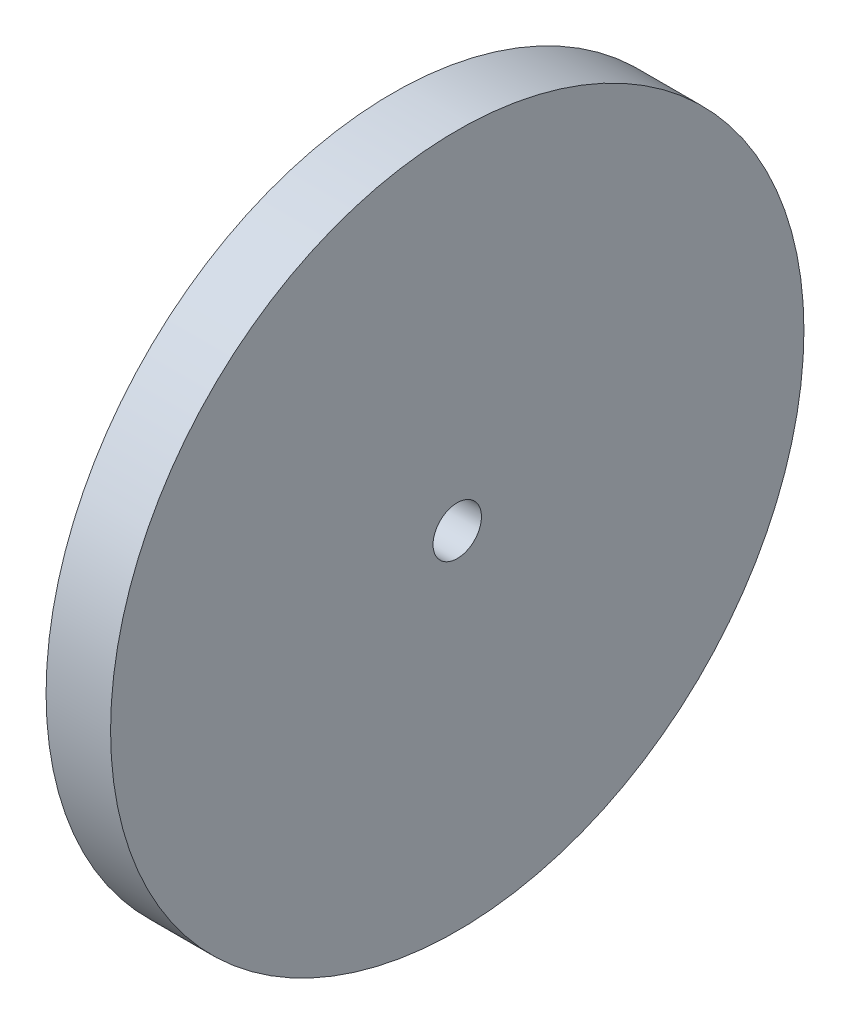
from build123d import *

# Parameters (mm, degrees)
ESQUISSE1_W = 40
ESQUISSE1_H = 200


with BuildPart() as part:
    # Esquisse1 → R_volution1 (revolve)
    with BuildSketch(Plane.XY, mode=Mode.PRIVATE) as r_volution1_sk:
        with Locations((20, 115)):
            Rectangle(ESQUISSE1_W, ESQUISSE1_H)
    revolve(r_volution1_sk.sketch.rotate(Axis((0, 0, 0), (1, 0, 0)), 90), axis=Axis((0, 0, 0), (1, 0, 0)))


solid = part.part
